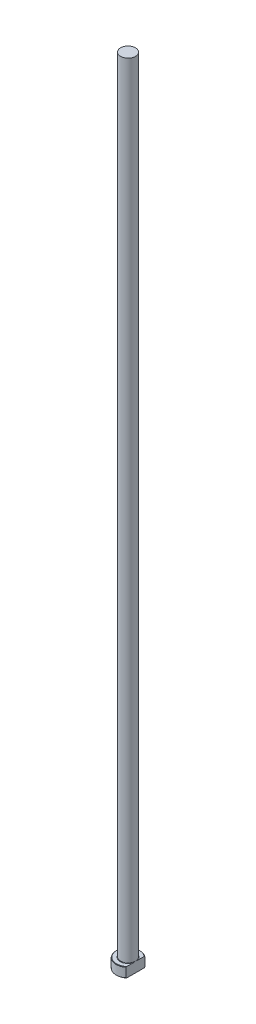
from build123d import *
from build123d.topology import SkipClean

# Parameters (mm, degrees)
CHAMFER1_SIZE = 0.2
FILLET1_R     = 0.2
KEY_DEPTH     = 401.089989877


with BuildPart() as part:
    # Sketch1 → Revolve1 (revolve)
    with BuildSketch(Plane.XY, mode=Mode.PRIVATE) as revolve1_sk:
        Polygon((0, 0), (-6, 0), (-6, 5), (-3.75, 5), (-3.75, 400), (0, 400), align=None)
    revolve(revolve1_sk.sketch.rotate(Axis((0, 259.958771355, 0), (0, -1, 0)), 270), axis=Axis((0, 259.958771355, 0), (0, -1, 0)))

    # Chamfer1
    chamfer1_edges = [part.edges().sort_by_distance(p)[0] for p in [
        (0, 5, -6),
        (0, 0, -6),
    ]]
    chamfer(chamfer1_edges, length=CHAMFER1_SIZE)

    # Fillet1
    fillet1_edges = [part.edges().sort_by_distance(p)[0] for p in [
        (0, 5, -3.75),
    ]]
    fillet(fillet1_edges, radius=FILLET1_R)

    # Sketch2 → KEY (cut, through all)
    with SkipClean():  # the faces are left unmerged after this step: merging them gives an invalid solid
        with BuildSketch(Plane(origin=(0, 0, 0), x_dir=(1, 0, 0), z_dir=(0, 1, 0))):
            with BuildLine():
                Line((3.75, 4.683748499), (3.75, -4.683748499))
                ThreePointArc((3.75, -4.683748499), (6, 0), (3.75, 4.683748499))
            make_face()
        extrude(amount=KEY_DEPTH, mode=Mode.SUBTRACT)


solid = part.part
